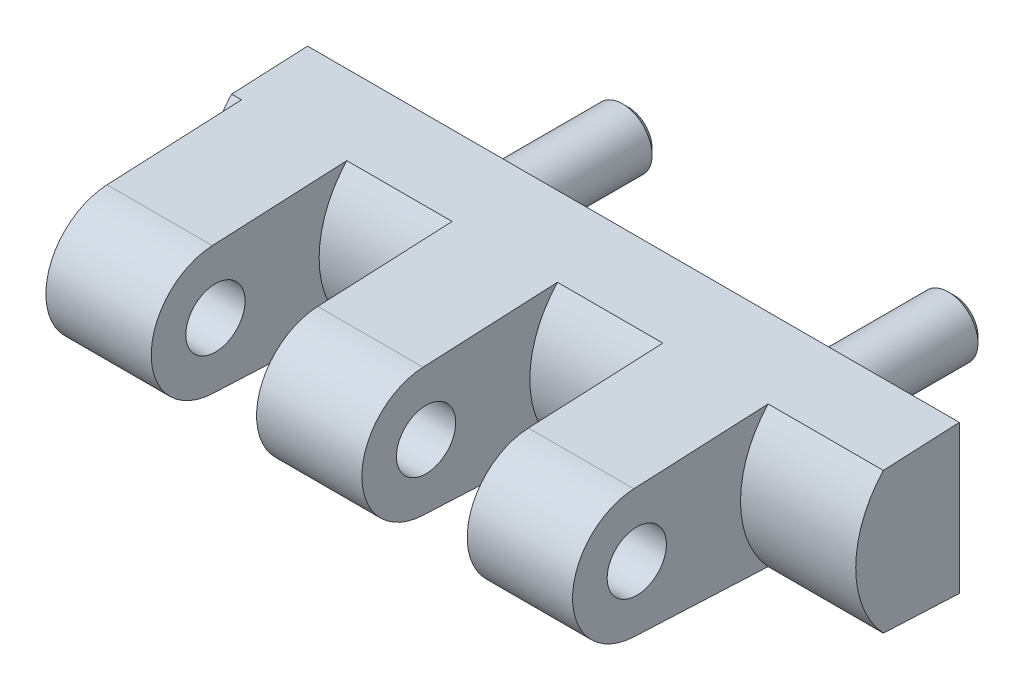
ISO-10303-21;
HEADER;
FILE_DESCRIPTION(('STEP AP214'),'2;1');
FILE_NAME('part.step','',(''),(''),'','','');
FILE_SCHEMA(('AUTOMOTIVE_DESIGN { 1 0 10303 214 1 1 1 1 }'));
ENDSEC;
DATA;
#1=APPLICATION_CONTEXT('core data for automotive mechanical design processes');
#2=APPLICATION_PROTOCOL_DEFINITION('international standard','automotive_design',2000,#1);
#3=PRODUCT_CONTEXT('',#1,'mechanical');
#4=PRODUCT('Part','Part','',(#3));
#5=PRODUCT_RELATED_PRODUCT_CATEGORY('part','',(#4));
#6=PRODUCT_DEFINITION_FORMATION('','',#4);
#7=PRODUCT_DEFINITION_CONTEXT('part definition',#1,'design');
#8=PRODUCT_DEFINITION('design','',#6,#7);
#9=PRODUCT_DEFINITION_SHAPE('','',#8);
#10=(LENGTH_UNIT() NAMED_UNIT(*) SI_UNIT(.MILLI.,.METRE.));
#11=(NAMED_UNIT(*) PLANE_ANGLE_UNIT() SI_UNIT($,.RADIAN.));
#12=(NAMED_UNIT(*) SI_UNIT($,.STERADIAN.) SOLID_ANGLE_UNIT());
#13=UNCERTAINTY_MEASURE_WITH_UNIT(LENGTH_MEASURE(1.E-05),#10,'distance_accuracy_value','');
#14=(GEOMETRIC_REPRESENTATION_CONTEXT(3) GLOBAL_UNCERTAINTY_ASSIGNED_CONTEXT((#13)) GLOBAL_UNIT_ASSIGNED_CONTEXT((#10,
#11,#12)) REPRESENTATION_CONTEXT('',''));
#15=CARTESIAN_POINT('',(0.,0.,0.));
#16=DIRECTION('',(0.,0.,1.));
#17=DIRECTION('',(1.,0.,0.));
#18=AXIS2_PLACEMENT_3D('',#15,#16,#17);
#19=CARTESIAN_POINT('',(37.833333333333,-10.496183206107,0.));
#20=DIRECTION('',(1.,0.,0.));
#21=DIRECTION('',(0.,-1.,0.));
#22=AXIS2_PLACEMENT_3D('',#19,#20,#21);
#23=PLANE('',#22);
#24=CARTESIAN_POINT('',(37.833333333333,0.,21.));
#25=DIRECTION('',(-1.,0.,0.));
#26=DIRECTION('',(0.,-1.,0.));
#27=AXIS2_PLACEMENT_3D('',#24,#25,#26);
#28=CIRCLE('',#27,6.5);
#29=CARTESIAN_POINT('',(37.833333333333,6.4927491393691,21.306934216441));
#30=VERTEX_POINT('',#29);
#31=CARTESIAN_POINT('',(37.833333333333,-6.4927491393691,21.306934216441));
#32=VERTEX_POINT('',#31);
#33=EDGE_CURVE('E247',#30,#32,#28,.F.);
#34=ORIENTED_EDGE('',*,*,#33,.T.);
#35=DIRECTION('',(0.,-0.0472206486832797,-0.998884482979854));
#36=VECTOR('',#35,1.);
#37=CARTESIAN_POINT('',(37.833333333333,-7.5,0.));
#38=LINE('',#37,#36);
#39=CARTESIAN_POINT('',(37.833333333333,-7.13613161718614,7.69710903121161));
#40=VERTEX_POINT('',#39);
#41=EDGE_CURVE('E202',#32,#40,#38,.T.);
#42=ORIENTED_EDGE('',*,*,#41,.T.);
#43=CARTESIAN_POINT('',(37.833333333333,0.,0.));
#44=DIRECTION('',(-1.,0.,0.));
#45=DIRECTION('',(0.,-1.,0.));
#46=AXIS2_PLACEMENT_3D('',#43,#44,#45);
#47=CIRCLE('',#46,10.496183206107);
#48=CARTESIAN_POINT('',(37.833333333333,7.13613161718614,7.69710903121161));
#49=VERTEX_POINT('',#48);
#50=EDGE_CURVE('E181',#40,#49,#47,.T.);
#51=ORIENTED_EDGE('',*,*,#50,.T.);
#52=DIRECTION('',(0.,0.0472206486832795,-0.998884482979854));
#53=VECTOR('',#52,1.);
#54=CARTESIAN_POINT('',(37.833333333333,6.4927491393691,21.306934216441));
#55=LINE('',#54,#53);
#56=EDGE_CURVE('E172',#30,#49,#55,.T.);
#57=ORIENTED_EDGE('',*,*,#56,.F.);
#58=EDGE_LOOP('',(#34,#42,#51,#57));
#59=FACE_BOUND('',#58,.T.);
#60=CARTESIAN_POINT('',(37.833333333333,0.,21.));
#61=DIRECTION('',(-1.,0.,0.));
#62=DIRECTION('',(0.,-1.,0.));
#63=AXIS2_PLACEMENT_3D('',#60,#61,#62);
#64=CIRCLE('',#63,3.);
#65=CARTESIAN_POINT('',(37.833333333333,-3.,21.));
#66=VERTEX_POINT('',#65);
#67=EDGE_CURVE('E360',#66,#66,#64,.F.);
#68=ORIENTED_EDGE('',*,*,#67,.F.);
#69=EDGE_LOOP('',(#68));
#70=FACE_BOUND('',#69,.T.);
#71=ADVANCED_FACE('F14',(#59,#70),#23,.T.);
#72=CARTESIAN_POINT('',(27.166666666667,-33.,0.));
#73=DIRECTION('',(-1.,0.,0.));
#74=DIRECTION('',(0.,1.,0.));
#75=AXIS2_PLACEMENT_3D('',#72,#73,#74);
#76=PLANE('',#75);
#77=CARTESIAN_POINT('',(27.166666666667,0.,0.));
#78=DIRECTION('',(-1.,0.,0.));
#79=DIRECTION('',(0.,-1.,0.));
#80=AXIS2_PLACEMENT_3D('',#77,#78,#79);
#81=CIRCLE('',#80,10.496183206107);
#82=CARTESIAN_POINT('',(27.166666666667,-7.13613161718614,7.69710903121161));
#83=VERTEX_POINT('',#82);
#84=CARTESIAN_POINT('',(27.166666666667,7.13613161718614,7.69710903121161));
#85=VERTEX_POINT('',#84);
#86=EDGE_CURVE('E138',#83,#85,#81,.T.);
#87=ORIENTED_EDGE('',*,*,#86,.F.);
#88=DIRECTION('',(0.,0.0472206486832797,0.998884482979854));
#89=VECTOR('',#88,1.);
#90=CARTESIAN_POINT('',(27.166666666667,-7.5,0.));
#91=LINE('',#90,#89);
#92=CARTESIAN_POINT('',(27.166666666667,-6.4927491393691,21.306934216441));
#93=VERTEX_POINT('',#92);
#94=EDGE_CURVE('E199',#83,#93,#91,.T.);
#95=ORIENTED_EDGE('',*,*,#94,.T.);
#96=CARTESIAN_POINT('',(27.166666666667,0.,21.));
#97=DIRECTION('',(1.,0.,0.));
#98=DIRECTION('',(0.,1.,0.));
#99=AXIS2_PLACEMENT_3D('',#96,#97,#98);
#100=CIRCLE('',#99,6.5);
#101=CARTESIAN_POINT('',(27.166666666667,6.4927491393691,21.306934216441));
#102=VERTEX_POINT('',#101);
#103=EDGE_CURVE('E244',#93,#102,#100,.F.);
#104=ORIENTED_EDGE('',*,*,#103,.T.);
#105=DIRECTION('',(0.,-0.0472206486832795,0.998884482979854));
#106=VECTOR('',#105,1.);
#107=CARTESIAN_POINT('',(27.166666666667,6.4927491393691,21.306934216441));
#108=LINE('',#107,#106);
#109=EDGE_CURVE('E152',#85,#102,#108,.T.);
#110=ORIENTED_EDGE('',*,*,#109,.F.);
#111=EDGE_LOOP('',(#87,#95,#104,#110));
#112=FACE_BOUND('',#111,.T.);
#113=CARTESIAN_POINT('',(27.166666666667,0.,21.));
#114=DIRECTION('',(1.,0.,0.));
#115=DIRECTION('',(0.,1.,0.));
#116=AXIS2_PLACEMENT_3D('',#113,#114,#115);
#117=CIRCLE('',#116,3.);
#118=CARTESIAN_POINT('',(27.166666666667,3.,21.));
#119=VERTEX_POINT('',#118);
#120=EDGE_CURVE('E357',#119,#119,#117,.F.);
#121=ORIENTED_EDGE('',*,*,#120,.F.);
#122=EDGE_LOOP('',(#121));
#123=FACE_BOUND('',#122,.T.);
#124=ADVANCED_FACE('F280',(#112,#123),#76,.T.);
#125=CARTESIAN_POINT('',(-16.5,0.,21.));
#126=DIRECTION('',(1.,0.,0.));
#127=DIRECTION('',(0.,-1.,0.));
#128=AXIS2_PLACEMENT_3D('',#125,#126,#127);
#129=CYLINDRICAL_SURFACE('',#128,6.5);
#130=DIRECTION('',(1.,0.,0.));
#131=VECTOR('',#130,1.);
#132=CARTESIAN_POINT('',(-16.5,6.4927491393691,21.306934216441));
#133=LINE('',#132,#131);
#134=EDGE_CURVE('E216',#102,#30,#133,.T.);
#135=ORIENTED_EDGE('',*,*,#134,.F.);
#136=ORIENTED_EDGE('',*,*,#103,.F.);
#137=DIRECTION('',(1.,0.,0.));
#138=VECTOR('',#137,1.);
#139=CARTESIAN_POINT('',(-16.5,-6.4927491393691,21.306934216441));
#140=LINE('',#139,#138);
#141=EDGE_CURVE('E220',#93,#32,#140,.T.);
#142=ORIENTED_EDGE('',*,*,#141,.T.);
#143=ORIENTED_EDGE('',*,*,#33,.F.);
#144=EDGE_LOOP('',(#135,#136,#142,#143));
#145=FACE_BOUND('',#144,.T.);
#146=ADVANCED_FACE('F287',(#145),#129,.T.);
#147=CARTESIAN_POINT('',(5.833333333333,6.4927491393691,21.306934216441));
#148=VERTEX_POINT('',#147);
#149=CARTESIAN_POINT('',(16.5,6.4927491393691,21.306934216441));
#150=VERTEX_POINT('',#149);
#151=EDGE_CURVE('E151',#148,#150,#133,.T.);
#152=ORIENTED_EDGE('',*,*,#151,.F.);
#153=CARTESIAN_POINT('',(5.833333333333,0.,21.));
#154=DIRECTION('',(1.,0.,0.));
#155=DIRECTION('',(0.,1.,0.));
#156=AXIS2_PLACEMENT_3D('',#153,#154,#155);
#157=CIRCLE('',#156,6.5);
#158=CARTESIAN_POINT('',(5.833333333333,-6.4927491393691,21.306934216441));
#159=VERTEX_POINT('',#158);
#160=EDGE_CURVE('E239',#159,#148,#157,.F.);
#161=ORIENTED_EDGE('',*,*,#160,.F.);
#162=CARTESIAN_POINT('',(16.5,-6.4927491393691,21.306934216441));
#163=VERTEX_POINT('',#162);
#164=EDGE_CURVE('E222',#159,#163,#140,.T.);
#165=ORIENTED_EDGE('',*,*,#164,.T.);
#166=CARTESIAN_POINT('',(16.5,0.,21.));
#167=DIRECTION('',(-1.,0.,0.));
#168=DIRECTION('',(0.,-1.,0.));
#169=AXIS2_PLACEMENT_3D('',#166,#167,#168);
#170=CIRCLE('',#169,6.5);
#171=EDGE_CURVE('E242',#150,#163,#170,.F.);
#172=ORIENTED_EDGE('',*,*,#171,.F.);
#173=EDGE_LOOP('',(#152,#161,#165,#172));
#174=FACE_BOUND('',#173,.T.);
#175=ADVANCED_FACE('F310',(#174),#129,.T.);
#176=CARTESIAN_POINT('',(-16.5,-7.5,0.));
#177=DIRECTION('',(0.,-0.998884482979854,0.0472206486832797));
#178=DIRECTION('',(0.,0.0472206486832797,0.998884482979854));
#179=AXIS2_PLACEMENT_3D('',#176,#177,#178);
#180=PLANE('',#179);
#181=ORIENTED_EDGE('',*,*,#41,.F.);
#182=ORIENTED_EDGE('',*,*,#141,.F.);
#183=ORIENTED_EDGE('',*,*,#94,.F.);
#184=DIRECTION('',(1.,0.,0.));
#185=VECTOR('',#184,1.);
#186=CARTESIAN_POINT('',(-33.5,-7.13613161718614,7.69710903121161));
#187=LINE('',#186,#185);
#188=CARTESIAN_POINT('',(16.5,-7.13613161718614,7.69710903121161));
#189=VERTEX_POINT('',#188);
#190=EDGE_CURVE('E253',#189,#83,#187,.T.);
#191=ORIENTED_EDGE('',*,*,#190,.F.);
#192=DIRECTION('',(0.,-0.0472206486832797,-0.998884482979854));
#193=VECTOR('',#192,1.);
#194=CARTESIAN_POINT('',(16.5,-7.5,0.));
#195=LINE('',#194,#193);
#196=EDGE_CURVE('E135',#163,#189,#195,.T.);
#197=ORIENTED_EDGE('',*,*,#196,.F.);
#198=ORIENTED_EDGE('',*,*,#164,.F.);
#199=DIRECTION('',(0.,0.0472206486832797,0.998884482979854));
#200=VECTOR('',#199,1.);
#201=CARTESIAN_POINT('',(5.833333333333,-7.5,0.));
#202=LINE('',#201,#200);
#203=CARTESIAN_POINT('',(5.833333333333,-7.13613161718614,7.69710903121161));
#204=VERTEX_POINT('',#203);
#205=EDGE_CURVE('E196',#204,#159,#202,.T.);
#206=ORIENTED_EDGE('',*,*,#205,.F.);
#207=DIRECTION('',(1.,0.,0.));
#208=VECTOR('',#207,1.);
#209=CARTESIAN_POINT('',(-33.5,-7.13613161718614,7.69710903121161));
#210=LINE('',#209,#208);
#211=CARTESIAN_POINT('',(-4.833333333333,-7.13613161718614,7.69710903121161));
#212=VERTEX_POINT('',#211);
#213=EDGE_CURVE('E250',#212,#204,#210,.T.);
#214=ORIENTED_EDGE('',*,*,#213,.F.);
#215=DIRECTION('',(0.,-0.0472206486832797,-0.998884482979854));
#216=VECTOR('',#215,1.);
#217=CARTESIAN_POINT('',(-4.833333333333,-7.5,0.));
#218=LINE('',#217,#216);
#219=CARTESIAN_POINT('',(-4.833333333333,-6.4927491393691,21.306934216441));
#220=VERTEX_POINT('',#219);
#221=EDGE_CURVE('E193',#220,#212,#218,.T.);
#222=ORIENTED_EDGE('',*,*,#221,.F.);
#223=CARTESIAN_POINT('',(-15.5,-6.4927491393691,21.306934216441));
#224=VERTEX_POINT('',#223);
#225=EDGE_CURVE('E223',#224,#220,#140,.T.);
#226=ORIENTED_EDGE('',*,*,#225,.F.);
#227=DIRECTION('',(0.,0.0472206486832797,0.998884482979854));
#228=VECTOR('',#227,1.);
#229=CARTESIAN_POINT('',(-15.5,-7.5,0.));
#230=LINE('',#229,#228);
#231=CARTESIAN_POINT('',(-15.5,-7.13613161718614,7.69710903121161));
#232=VERTEX_POINT('',#231);
#233=EDGE_CURVE('E190',#232,#224,#230,.T.);
#234=ORIENTED_EDGE('',*,*,#233,.F.);
#235=DIRECTION('',(1.,0.,0.));
#236=VECTOR('',#235,1.);
#237=CARTESIAN_POINT('',(-33.5,-7.13613161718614,7.69710903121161));
#238=LINE('',#237,#236);
#239=CARTESIAN_POINT('',(-16.5,-7.13613161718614,7.69710903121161));
#240=VERTEX_POINT('',#239);
#241=EDGE_CURVE('E187',#240,#232,#238,.T.);
#242=ORIENTED_EDGE('',*,*,#241,.F.);
#243=DIRECTION('',(0.,0.0472206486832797,0.998884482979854));
#244=VECTOR('',#243,1.);
#245=CARTESIAN_POINT('',(-16.5,-7.5,0.));
#246=LINE('',#245,#244);
#247=CARTESIAN_POINT('',(-16.5,-7.5,0.));
#248=VERTEX_POINT('',#247);
#249=EDGE_CURVE('E214',#248,#240,#246,.T.);
#250=ORIENTED_EDGE('',*,*,#249,.F.);
#251=DIRECTION('',(1.,0.,0.));
#252=VECTOR('',#251,1.);
#253=CARTESIAN_POINT('',(-16.5,-7.5,0.));
#254=LINE('',#253,#252);
#255=CARTESIAN_POINT('',(49.5,-7.5,0.));
#256=VERTEX_POINT('',#255);
#257=EDGE_CURVE('E224',#248,#256,#254,.T.);
#258=ORIENTED_EDGE('',*,*,#257,.T.);
#259=DIRECTION('',(0.,0.0472206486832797,0.998884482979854));
#260=VECTOR('',#259,1.);
#261=CARTESIAN_POINT('',(49.5,-7.5,0.));
#262=LINE('',#261,#260);
#263=CARTESIAN_POINT('',(49.5,-7.13613161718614,7.69710903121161));
#264=VERTEX_POINT('',#263);
#265=EDGE_CURVE('E208',#256,#264,#262,.T.);
#266=ORIENTED_EDGE('',*,*,#265,.T.);
#267=DIRECTION('',(1.,0.,0.));
#268=VECTOR('',#267,1.);
#269=CARTESIAN_POINT('',(-33.5,-7.13613161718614,7.69710903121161));
#270=LINE('',#269,#268);
#271=EDGE_CURVE('E184',#40,#264,#270,.T.);
#272=ORIENTED_EDGE('',*,*,#271,.F.);
#273=EDGE_LOOP('',(#181,#182,#183,#191,#197,#198,#206,#214,#222,#226,#234,#242,#250,#258,#266,#272));
#274=FACE_BOUND('',#273,.T.);
#275=ADVANCED_FACE('F308',(#274),#180,.T.);
#276=CARTESIAN_POINT('',(-15.5,6.4927491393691,21.306934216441));
#277=VERTEX_POINT('',#276);
#278=CARTESIAN_POINT('',(-4.833333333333,6.4927491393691,21.306934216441));
#279=VERTEX_POINT('',#278);
#280=EDGE_CURVE('E219',#277,#279,#133,.T.);
#281=ORIENTED_EDGE('',*,*,#280,.F.);
#282=CARTESIAN_POINT('',(-15.5,0.,21.));
#283=DIRECTION('',(1.,0.,0.));
#284=DIRECTION('',(0.,1.,0.));
#285=AXIS2_PLACEMENT_3D('',#282,#283,#284);
#286=CIRCLE('',#285,6.5);
#287=EDGE_CURVE('E234',#224,#277,#286,.F.);
#288=ORIENTED_EDGE('',*,*,#287,.F.);
#289=ORIENTED_EDGE('',*,*,#225,.T.);
#290=CARTESIAN_POINT('',(-4.833333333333,0.,21.));
#291=DIRECTION('',(-1.,0.,0.));
#292=DIRECTION('',(0.,-1.,0.));
#293=AXIS2_PLACEMENT_3D('',#290,#291,#292);
#294=CIRCLE('',#293,6.5);
#295=EDGE_CURVE('E237',#279,#220,#294,.F.);
#296=ORIENTED_EDGE('',*,*,#295,.F.);
#297=EDGE_LOOP('',(#281,#288,#289,#296));
#298=FACE_BOUND('',#297,.T.);
#299=ADVANCED_FACE('F305',(#298),#129,.T.);
#300=CARTESIAN_POINT('',(-16.5,0.,21.));
#301=DIRECTION('',(1.,0.,0.));
#302=DIRECTION('',(0.,-1.,0.));
#303=AXIS2_PLACEMENT_3D('',#300,#301,#302);
#304=PLANE('',#303);
#305=DIRECTION('',(0.,0.0472206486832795,-0.998884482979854));
#306=VECTOR('',#305,1.);
#307=CARTESIAN_POINT('',(-16.5,6.4927491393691,21.306934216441));
#308=LINE('',#307,#306);
#309=CARTESIAN_POINT('',(-16.5,7.13613161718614,7.69710903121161));
#310=VERTEX_POINT('',#309);
#311=CARTESIAN_POINT('',(-16.5,7.5,0.));
#312=VERTEX_POINT('',#311);
#313=EDGE_CURVE('E211',#310,#312,#308,.T.);
#314=ORIENTED_EDGE('',*,*,#313,.T.);
#315=DIRECTION('',(0.,-1.,0.));
#316=VECTOR('',#315,1.);
#317=CARTESIAN_POINT('',(-16.5,7.5,0.));
#318=LINE('',#317,#316);
#319=EDGE_CURVE('E29',#312,#248,#318,.T.);
#320=ORIENTED_EDGE('',*,*,#319,.T.);
#321=ORIENTED_EDGE('',*,*,#249,.T.);
#322=CARTESIAN_POINT('',(-16.5,0.,0.));
#323=DIRECTION('',(-1.,0.,0.));
#324=DIRECTION('',(0.,-1.,0.));
#325=AXIS2_PLACEMENT_3D('',#322,#323,#324);
#326=CIRCLE('',#325,10.496183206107);
#327=EDGE_CURVE('E231',#240,#310,#326,.T.);
#328=ORIENTED_EDGE('',*,*,#327,.T.);
#329=EDGE_LOOP('',(#314,#320,#321,#328));
#330=FACE_BOUND('',#329,.T.);
#331=ADVANCED_FACE('F301',(#330),#304,.F.);
#332=CARTESIAN_POINT('',(49.5,0.,21.));
#333=DIRECTION('',(1.,0.,0.));
#334=DIRECTION('',(0.,-1.,0.));
#335=AXIS2_PLACEMENT_3D('',#332,#333,#334);
#336=PLANE('',#335);
#337=CARTESIAN_POINT('',(49.5,0.,0.));
#338=DIRECTION('',(-1.,0.,0.));
#339=DIRECTION('',(0.,-1.,0.));
#340=AXIS2_PLACEMENT_3D('',#337,#338,#339);
#341=CIRCLE('',#340,10.496183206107);
#342=CARTESIAN_POINT('',(49.5,7.13613161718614,7.69710903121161));
#343=VERTEX_POINT('',#342);
#344=EDGE_CURVE('E228',#264,#343,#341,.T.);
#345=ORIENTED_EDGE('',*,*,#344,.F.);
#346=ORIENTED_EDGE('',*,*,#265,.F.);
#347=DIRECTION('',(0.,-1.,0.));
#348=VECTOR('',#347,1.);
#349=CARTESIAN_POINT('',(49.5,7.5,0.));
#350=LINE('',#349,#348);
#351=CARTESIAN_POINT('',(49.5,7.5,0.));
#352=VERTEX_POINT('',#351);
#353=EDGE_CURVE('E206',#352,#256,#350,.T.);
#354=ORIENTED_EDGE('',*,*,#353,.F.);
#355=DIRECTION('',(0.,0.0472206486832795,-0.998884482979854));
#356=VECTOR('',#355,1.);
#357=CARTESIAN_POINT('',(49.5,6.4927491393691,21.306934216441));
#358=LINE('',#357,#356);
#359=EDGE_CURVE('E205',#343,#352,#358,.T.);
#360=ORIENTED_EDGE('',*,*,#359,.F.);
#361=EDGE_LOOP('',(#345,#346,#354,#360));
#362=FACE_BOUND('',#361,.T.);
#363=ADVANCED_FACE('F298',(#362),#336,.T.);
#364=CARTESIAN_POINT('',(-16.5,6.4927491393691,21.306934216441));
#365=DIRECTION('',(0.,0.998884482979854,0.0472206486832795));
#366=DIRECTION('',(0.,0.0472206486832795,-0.998884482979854));
#367=AXIS2_PLACEMENT_3D('',#364,#365,#366);
#368=PLANE('',#367);
#369=DIRECTION('',(-1.,0.,0.));
#370=VECTOR('',#369,1.);
#371=CARTESIAN_POINT('',(-33.5,7.13613161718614,7.69710903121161));
#372=LINE('',#371,#370);
#373=EDGE_CURVE('E170',#49,#343,#372,.F.);
#374=ORIENTED_EDGE('',*,*,#373,.T.);
#375=ORIENTED_EDGE('',*,*,#359,.T.);
#376=DIRECTION('',(1.,0.,0.));
#377=VECTOR('',#376,1.);
#378=CARTESIAN_POINT('',(-16.5,7.5,0.));
#379=LINE('',#378,#377);
#380=EDGE_CURVE('E37',#312,#352,#379,.T.);
#381=ORIENTED_EDGE('',*,*,#380,.F.);
#382=ORIENTED_EDGE('',*,*,#313,.F.);
#383=DIRECTION('',(-1.,0.,0.));
#384=VECTOR('',#383,1.);
#385=CARTESIAN_POINT('',(-33.5,7.13613161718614,7.69710903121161));
#386=LINE('',#385,#384);
#387=CARTESIAN_POINT('',(-15.5,7.13613161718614,7.69710903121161));
#388=VERTEX_POINT('',#387);
#389=EDGE_CURVE('E165',#310,#388,#386,.F.);
#390=ORIENTED_EDGE('',*,*,#389,.T.);
#391=DIRECTION('',(0.,-0.0472206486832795,0.998884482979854));
#392=VECTOR('',#391,1.);
#393=CARTESIAN_POINT('',(-15.5,6.4927491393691,21.306934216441));
#394=LINE('',#393,#392);
#395=EDGE_CURVE('E168',#388,#277,#394,.T.);
#396=ORIENTED_EDGE('',*,*,#395,.T.);
#397=ORIENTED_EDGE('',*,*,#280,.T.);
#398=DIRECTION('',(0.,0.0472206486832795,-0.998884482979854));
#399=VECTOR('',#398,1.);
#400=CARTESIAN_POINT('',(-4.833333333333,6.4927491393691,21.306934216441));
#401=LINE('',#400,#399);
#402=CARTESIAN_POINT('',(-4.833333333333,7.13613161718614,7.69710903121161));
#403=VERTEX_POINT('',#402);
#404=EDGE_CURVE('E154',#279,#403,#401,.T.);
#405=ORIENTED_EDGE('',*,*,#404,.T.);
#406=DIRECTION('',(-1.,0.,0.));
#407=VECTOR('',#406,1.);
#408=CARTESIAN_POINT('',(-33.5,7.13613161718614,7.69710903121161));
#409=LINE('',#408,#407);
#410=CARTESIAN_POINT('',(5.833333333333,7.13613161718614,7.69710903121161));
#411=VERTEX_POINT('',#410);
#412=EDGE_CURVE('E162',#403,#411,#409,.F.);
#413=ORIENTED_EDGE('',*,*,#412,.T.);
#414=DIRECTION('',(0.,-0.0472206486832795,0.998884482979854));
#415=VECTOR('',#414,1.);
#416=CARTESIAN_POINT('',(5.833333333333,6.4927491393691,21.306934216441));
#417=LINE('',#416,#415);
#418=EDGE_CURVE('E160',#411,#148,#417,.T.);
#419=ORIENTED_EDGE('',*,*,#418,.T.);
#420=ORIENTED_EDGE('',*,*,#151,.T.);
#421=DIRECTION('',(0.,0.0472206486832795,-0.998884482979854));
#422=VECTOR('',#421,1.);
#423=CARTESIAN_POINT('',(16.5,6.4927491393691,21.306934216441));
#424=LINE('',#423,#422);
#425=CARTESIAN_POINT('',(16.5,7.13613161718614,7.69710903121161));
#426=VERTEX_POINT('',#425);
#427=EDGE_CURVE('E133',#150,#426,#424,.T.);
#428=ORIENTED_EDGE('',*,*,#427,.T.);
#429=DIRECTION('',(-1.,0.,0.));
#430=VECTOR('',#429,1.);
#431=CARTESIAN_POINT('',(-33.5,7.13613161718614,7.69710903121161));
#432=LINE('',#431,#430);
#433=EDGE_CURVE('E142',#426,#85,#432,.F.);
#434=ORIENTED_EDGE('',*,*,#433,.T.);
#435=ORIENTED_EDGE('',*,*,#109,.T.);
#436=ORIENTED_EDGE('',*,*,#134,.T.);
#437=ORIENTED_EDGE('',*,*,#56,.T.);
#438=EDGE_LOOP('',(#374,#375,#381,#382,#390,#396,#397,#405,#413,#419,#420,#428,#434,#435,#436,#437));
#439=FACE_BOUND('',#438,.T.);
#440=ADVANCED_FACE('F16',(#439),#368,.T.);
#441=CARTESIAN_POINT('',(-16.5,7.5,0.));
#442=DIRECTION('',(0.,0.,-1.));
#443=DIRECTION('',(-1.,0.,0.));
#444=AXIS2_PLACEMENT_3D('',#441,#442,#443);
#445=PLANE('',#444);
#446=CARTESIAN_POINT('',(0.,0.,0.));
#447=DIRECTION('',(0.,0.,1.));
#448=DIRECTION('',(-1.,0.,0.));
#449=AXIS2_PLACEMENT_3D('',#446,#447,#448);
#450=CIRCLE('',#449,3.);
#451=CARTESIAN_POINT('',(-3.,0.,0.));
#452=VERTEX_POINT('',#451);
#453=EDGE_CURVE('E9',#452,#452,#450,.T.);
#454=ORIENTED_EDGE('',*,*,#453,.T.);
#455=EDGE_LOOP('',(#454));
#456=FACE_BOUND('',#455,.T.);
#457=CARTESIAN_POINT('',(33.,0.,0.));
#458=DIRECTION('',(0.,0.,1.));
#459=DIRECTION('',(-1.,0.,0.));
#460=AXIS2_PLACEMENT_3D('',#457,#458,#459);
#461=CIRCLE('',#460,3.);
#462=CARTESIAN_POINT('',(30.,0.,0.));
#463=VERTEX_POINT('',#462);
#464=EDGE_CURVE('E22',#463,#463,#461,.T.);
#465=ORIENTED_EDGE('',*,*,#464,.T.);
#466=EDGE_LOOP('',(#465));
#467=FACE_BOUND('',#466,.T.);
#468=ORIENTED_EDGE('',*,*,#257,.F.);
#469=ORIENTED_EDGE('',*,*,#319,.F.);
#470=ORIENTED_EDGE('',*,*,#380,.T.);
#471=ORIENTED_EDGE('',*,*,#353,.T.);
#472=EDGE_LOOP('',(#468,#469,#470,#471));
#473=FACE_BOUND('',#472,.T.);
#474=ADVANCED_FACE('F257',(#456,#467,#473),#445,.T.);
#475=CARTESIAN_POINT('',(-33.5,0.,0.));
#476=DIRECTION('',(1.,0.,0.));
#477=DIRECTION('',(0.,-1.,0.));
#478=AXIS2_PLACEMENT_3D('',#475,#476,#477);
#479=CYLINDRICAL_SURFACE('',#478,10.496183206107);
#480=ORIENTED_EDGE('',*,*,#50,.F.);
#481=ORIENTED_EDGE('',*,*,#271,.T.);
#482=ORIENTED_EDGE('',*,*,#344,.T.);
#483=ORIENTED_EDGE('',*,*,#373,.F.);
#484=EDGE_LOOP('',(#480,#481,#482,#483));
#485=FACE_BOUND('',#484,.T.);
#486=ADVANCED_FACE('F293',(#485),#479,.T.);
#487=CARTESIAN_POINT('',(-33.5,0.,0.));
#488=DIRECTION('',(1.,0.,0.));
#489=DIRECTION('',(0.,-1.,0.));
#490=AXIS2_PLACEMENT_3D('',#487,#488,#489);
#491=CYLINDRICAL_SURFACE('',#490,10.496183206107);
#492=ORIENTED_EDGE('',*,*,#327,.F.);
#493=ORIENTED_EDGE('',*,*,#241,.T.);
#494=CARTESIAN_POINT('',(-15.5,0.,0.));
#495=DIRECTION('',(-1.,0.,0.));
#496=DIRECTION('',(0.,-1.,0.));
#497=AXIS2_PLACEMENT_3D('',#494,#495,#496);
#498=CIRCLE('',#497,10.496183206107);
#499=EDGE_CURVE('E175',#232,#388,#498,.T.);
#500=ORIENTED_EDGE('',*,*,#499,.T.);
#501=ORIENTED_EDGE('',*,*,#389,.F.);
#502=EDGE_LOOP('',(#492,#493,#500,#501));
#503=FACE_BOUND('',#502,.T.);
#504=ADVANCED_FACE('F296',(#503),#491,.T.);
#505=CARTESIAN_POINT('',(-15.5,-33.,0.));
#506=DIRECTION('',(-1.,0.,0.));
#507=DIRECTION('',(0.,1.,0.));
#508=AXIS2_PLACEMENT_3D('',#505,#506,#507);
#509=PLANE('',#508);
#510=CARTESIAN_POINT('',(-15.5,0.,21.));
#511=DIRECTION('',(1.,0.,0.));
#512=DIRECTION('',(0.,1.,0.));
#513=AXIS2_PLACEMENT_3D('',#510,#511,#512);
#514=CIRCLE('',#513,3.);
#515=CARTESIAN_POINT('',(-15.5,3.,21.));
#516=VERTEX_POINT('',#515);
#517=EDGE_CURVE('E147',#516,#516,#514,.T.);
#518=ORIENTED_EDGE('',*,*,#517,.T.);
#519=EDGE_LOOP('',(#518));
#520=FACE_BOUND('',#519,.T.);
#521=ORIENTED_EDGE('',*,*,#499,.F.);
#522=ORIENTED_EDGE('',*,*,#233,.T.);
#523=ORIENTED_EDGE('',*,*,#287,.T.);
#524=ORIENTED_EDGE('',*,*,#395,.F.);
#525=EDGE_LOOP('',(#521,#522,#523,#524));
#526=FACE_BOUND('',#525,.T.);
#527=ADVANCED_FACE('F375',(#520,#526),#509,.T.);
#528=CARTESIAN_POINT('',(-4.833333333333,-10.496183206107,0.));
#529=DIRECTION('',(1.,0.,0.));
#530=DIRECTION('',(0.,-1.,0.));
#531=AXIS2_PLACEMENT_3D('',#528,#529,#530);
#532=PLANE('',#531);
#533=CARTESIAN_POINT('',(-4.833333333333,0.,21.));
#534=DIRECTION('',(-1.,0.,0.));
#535=DIRECTION('',(0.,-1.,0.));
#536=AXIS2_PLACEMENT_3D('',#533,#534,#535);
#537=CIRCLE('',#536,3.);
#538=CARTESIAN_POINT('',(-4.833333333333,-3.,21.));
#539=VERTEX_POINT('',#538);
#540=EDGE_CURVE('E370',#539,#539,#537,.T.);
#541=ORIENTED_EDGE('',*,*,#540,.T.);
#542=EDGE_LOOP('',(#541));
#543=FACE_BOUND('',#542,.T.);
#544=ORIENTED_EDGE('',*,*,#295,.T.);
#545=ORIENTED_EDGE('',*,*,#221,.T.);
#546=CARTESIAN_POINT('',(-4.833333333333,0.,0.));
#547=DIRECTION('',(-1.,0.,0.));
#548=DIRECTION('',(0.,-1.,0.));
#549=AXIS2_PLACEMENT_3D('',#546,#547,#548);
#550=CIRCLE('',#549,10.496183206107);
#551=EDGE_CURVE('E177',#212,#403,#550,.T.);
#552=ORIENTED_EDGE('',*,*,#551,.T.);
#553=ORIENTED_EDGE('',*,*,#404,.F.);
#554=EDGE_LOOP('',(#544,#545,#552,#553));
#555=FACE_BOUND('',#554,.T.);
#556=ADVANCED_FACE('F384',(#543,#555),#532,.T.);
#557=CARTESIAN_POINT('',(5.833333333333,-33.,0.));
#558=DIRECTION('',(-1.,0.,0.));
#559=DIRECTION('',(0.,1.,0.));
#560=AXIS2_PLACEMENT_3D('',#557,#558,#559);
#561=PLANE('',#560);
#562=CARTESIAN_POINT('',(5.833333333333,0.,21.));
#563=DIRECTION('',(1.,0.,0.));
#564=DIRECTION('',(0.,1.,0.));
#565=AXIS2_PLACEMENT_3D('',#562,#563,#564);
#566=CIRCLE('',#565,3.);
#567=CARTESIAN_POINT('',(5.833333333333,3.,21.));
#568=VERTEX_POINT('',#567);
#569=EDGE_CURVE('E367',#568,#568,#566,.T.);
#570=ORIENTED_EDGE('',*,*,#569,.T.);
#571=EDGE_LOOP('',(#570));
#572=FACE_BOUND('',#571,.T.);
#573=CARTESIAN_POINT('',(5.833333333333,0.,0.));
#574=DIRECTION('',(-1.,0.,0.));
#575=DIRECTION('',(0.,-1.,0.));
#576=AXIS2_PLACEMENT_3D('',#573,#574,#575);
#577=CIRCLE('',#576,10.496183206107);
#578=EDGE_CURVE('E139',#204,#411,#577,.T.);
#579=ORIENTED_EDGE('',*,*,#578,.F.);
#580=ORIENTED_EDGE('',*,*,#205,.T.);
#581=ORIENTED_EDGE('',*,*,#160,.T.);
#582=ORIENTED_EDGE('',*,*,#418,.F.);
#583=EDGE_LOOP('',(#579,#580,#581,#582));
#584=FACE_BOUND('',#583,.T.);
#585=ADVANCED_FACE('F387',(#572,#584),#561,.T.);
#586=CARTESIAN_POINT('',(-33.5,0.,0.));
#587=DIRECTION('',(1.,0.,0.));
#588=DIRECTION('',(0.,-1.,0.));
#589=AXIS2_PLACEMENT_3D('',#586,#587,#588);
#590=CYLINDRICAL_SURFACE('',#589,10.496183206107);
#591=ORIENTED_EDGE('',*,*,#551,.F.);
#592=ORIENTED_EDGE('',*,*,#213,.T.);
#593=ORIENTED_EDGE('',*,*,#578,.T.);
#594=ORIENTED_EDGE('',*,*,#412,.F.);
#595=EDGE_LOOP('',(#591,#592,#593,#594));
#596=FACE_BOUND('',#595,.T.);
#597=ADVANCED_FACE('F401',(#596),#590,.T.);
#598=CARTESIAN_POINT('',(-33.5,0.,0.));
#599=DIRECTION('',(1.,0.,0.));
#600=DIRECTION('',(0.,-1.,0.));
#601=AXIS2_PLACEMENT_3D('',#598,#599,#600);
#602=CYLINDRICAL_SURFACE('',#601,10.496183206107);
#603=CARTESIAN_POINT('',(16.5,0.,0.));
#604=DIRECTION('',(-1.,0.,0.));
#605=DIRECTION('',(0.,-1.,0.));
#606=AXIS2_PLACEMENT_3D('',#603,#604,#605);
#607=CIRCLE('',#606,10.496183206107);
#608=EDGE_CURVE('E128',#189,#426,#607,.T.);
#609=ORIENTED_EDGE('',*,*,#608,.F.);
#610=ORIENTED_EDGE('',*,*,#190,.T.);
#611=ORIENTED_EDGE('',*,*,#86,.T.);
#612=ORIENTED_EDGE('',*,*,#433,.F.);
#613=EDGE_LOOP('',(#609,#610,#611,#612));
#614=FACE_BOUND('',#613,.T.);
#615=ADVANCED_FACE('F143',(#614),#602,.T.);
#616=CARTESIAN_POINT('',(16.5,-10.496183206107,0.));
#617=DIRECTION('',(1.,0.,0.));
#618=DIRECTION('',(0.,-1.,0.));
#619=AXIS2_PLACEMENT_3D('',#616,#617,#618);
#620=PLANE('',#619);
#621=CARTESIAN_POINT('',(16.5,0.,21.));
#622=DIRECTION('',(-1.,0.,0.));
#623=DIRECTION('',(0.,-1.,0.));
#624=AXIS2_PLACEMENT_3D('',#621,#622,#623);
#625=CIRCLE('',#624,3.);
#626=CARTESIAN_POINT('',(16.5,-3.,21.));
#627=VERTEX_POINT('',#626);
#628=EDGE_CURVE('E363',#627,#627,#625,.T.);
#629=ORIENTED_EDGE('',*,*,#628,.T.);
#630=EDGE_LOOP('',(#629));
#631=FACE_BOUND('',#630,.T.);
#632=ORIENTED_EDGE('',*,*,#171,.T.);
#633=ORIENTED_EDGE('',*,*,#196,.T.);
#634=ORIENTED_EDGE('',*,*,#608,.T.);
#635=ORIENTED_EDGE('',*,*,#427,.F.);
#636=EDGE_LOOP('',(#632,#633,#634,#635));
#637=FACE_BOUND('',#636,.T.);
#638=ADVANCED_FACE('F131',(#631,#637),#620,.T.);
#639=CARTESIAN_POINT('',(-16.5,0.,21.));
#640=DIRECTION('',(1.,0.,0.));
#641=DIRECTION('',(0.,-1.,0.));
#642=AXIS2_PLACEMENT_3D('',#639,#640,#641);
#643=CYLINDRICAL_SURFACE('',#642,3.);
#644=ORIENTED_EDGE('',*,*,#569,.F.);
#645=EDGE_LOOP('',(#644));
#646=FACE_BOUND('',#645,.T.);
#647=ORIENTED_EDGE('',*,*,#628,.F.);
#648=EDGE_LOOP('',(#647));
#649=FACE_BOUND('',#648,.T.);
#650=ADVANCED_FACE('F380',(#646,#649),#643,.F.);
#651=ORIENTED_EDGE('',*,*,#517,.F.);
#652=EDGE_LOOP('',(#651));
#653=FACE_BOUND('',#652,.T.);
#654=ORIENTED_EDGE('',*,*,#540,.F.);
#655=EDGE_LOOP('',(#654));
#656=FACE_BOUND('',#655,.T.);
#657=ADVANCED_FACE('F275',(#653,#656),#643,.F.);
#658=CARTESIAN_POINT('',(49.5,0.,21.));
#659=DIRECTION('',(-1.,0.,0.));
#660=DIRECTION('',(0.,1.,0.));
#661=AXIS2_PLACEMENT_3D('',#658,#659,#660);
#662=CYLINDRICAL_SURFACE('',#661,3.);
#663=ORIENTED_EDGE('',*,*,#67,.T.);
#664=EDGE_LOOP('',(#663));
#665=FACE_BOUND('',#664,.T.);
#666=ORIENTED_EDGE('',*,*,#120,.T.);
#667=EDGE_LOOP('',(#666));
#668=FACE_BOUND('',#667,.T.);
#669=ADVANCED_FACE('F263',(#665,#668),#662,.F.);
#670=CARTESIAN_POINT('',(33.,0.,-16.));
#671=DIRECTION('',(0.,0.,1.));
#672=DIRECTION('',(0.,1.,0.));
#673=AXIS2_PLACEMENT_3D('',#670,#671,#672);
#674=CYLINDRICAL_SURFACE('',#673,3.);
#675=CARTESIAN_POINT('',(33.,0.,-15.3865));
#676=DIRECTION('',(0.,0.,-1.));
#677=DIRECTION('',(0.,1.,0.));
#678=AXIS2_PLACEMENT_3D('',#675,#676,#677);
#679=CIRCLE('',#678,3.);
#680=CARTESIAN_POINT('',(33.,3.,-15.3865));
#681=VERTEX_POINT('',#680);
#682=EDGE_CURVE('E354',#681,#681,#679,.T.);
#683=ORIENTED_EDGE('',*,*,#682,.F.);
#684=EDGE_LOOP('',(#683));
#685=FACE_BOUND('',#684,.T.);
#686=ORIENTED_EDGE('',*,*,#464,.F.);
#687=EDGE_LOOP('',(#686));
#688=FACE_BOUND('',#687,.T.);
#689=ADVANCED_FACE('F260',(#685,#688),#674,.T.);
#690=CARTESIAN_POINT('',(33.,0.,-15.3865));
#691=DIRECTION('',(0.,0.,1.));
#692=DIRECTION('',(0.,1.,0.));
#693=AXIS2_PLACEMENT_3D('',#690,#691,#692);
#694=CONICAL_SURFACE('',#693,3.,0.78539816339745);
#695=CARTESIAN_POINT('',(33.,0.,-16.));
#696=DIRECTION('',(0.,0.,-1.));
#697=DIRECTION('',(0.,1.,0.));
#698=AXIS2_PLACEMENT_3D('',#695,#696,#697);
#699=CIRCLE('',#698,2.3865);
#700=CARTESIAN_POINT('',(33.,2.3865,-16.));
#701=VERTEX_POINT('',#700);
#702=EDGE_CURVE('E349',#701,#701,#699,.T.);
#703=ORIENTED_EDGE('',*,*,#702,.F.);
#704=EDGE_LOOP('',(#703));
#705=FACE_BOUND('',#704,.T.);
#706=ORIENTED_EDGE('',*,*,#682,.T.);
#707=EDGE_LOOP('',(#706));
#708=FACE_BOUND('',#707,.T.);
#709=ADVANCED_FACE('F262',(#705,#708),#694,.T.);
#710=CARTESIAN_POINT('',(30.6135,0.,-16.));
#711=DIRECTION('',(0.,0.,-1.));
#712=DIRECTION('',(0.,-1.,0.));
#713=AXIS2_PLACEMENT_3D('',#710,#711,#712);
#714=PLANE('',#713);
#715=ORIENTED_EDGE('',*,*,#702,.T.);
#716=EDGE_LOOP('',(#715));
#717=FACE_BOUND('',#716,.T.);
#718=ADVANCED_FACE('F272',(#717),#714,.T.);
#719=CARTESIAN_POINT('',(0.,0.,-16.));
#720=DIRECTION('',(0.,0.,1.));
#721=DIRECTION('',(0.,1.,0.));
#722=AXIS2_PLACEMENT_3D('',#719,#720,#721);
#723=CYLINDRICAL_SURFACE('',#722,3.);
#724=CARTESIAN_POINT('',(0.,0.,-15.3865));
#725=DIRECTION('',(0.,0.,-1.));
#726=DIRECTION('',(0.,1.,0.));
#727=AXIS2_PLACEMENT_3D('',#724,#725,#726);
#728=CIRCLE('',#727,3.);
#729=CARTESIAN_POINT('',(0.,3.,-15.3865));
#730=VERTEX_POINT('',#729);
#731=EDGE_CURVE('E346',#730,#730,#728,.T.);
#732=ORIENTED_EDGE('',*,*,#731,.F.);
#733=EDGE_LOOP('',(#732));
#734=FACE_BOUND('',#733,.T.);
#735=ORIENTED_EDGE('',*,*,#453,.F.);
#736=EDGE_LOOP('',(#735));
#737=FACE_BOUND('',#736,.T.);
#738=ADVANCED_FACE('F321',(#734,#737),#723,.T.);
#739=CARTESIAN_POINT('',(0.,0.,-15.3865));
#740=DIRECTION('',(0.,0.,1.));
#741=DIRECTION('',(0.,1.,0.));
#742=AXIS2_PLACEMENT_3D('',#739,#740,#741);
#743=CONICAL_SURFACE('',#742,3.,0.785398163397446);
#744=CARTESIAN_POINT('',(0.,0.,-16.));
#745=DIRECTION('',(0.,0.,-1.));
#746=DIRECTION('',(0.,1.,0.));
#747=AXIS2_PLACEMENT_3D('',#744,#745,#746);
#748=CIRCLE('',#747,2.3865);
#749=CARTESIAN_POINT('',(0.,2.3865,-16.));
#750=VERTEX_POINT('',#749);
#751=EDGE_CURVE('E345',#750,#750,#748,.T.);
#752=ORIENTED_EDGE('',*,*,#751,.F.);
#753=EDGE_LOOP('',(#752));
#754=FACE_BOUND('',#753,.T.);
#755=ORIENTED_EDGE('',*,*,#731,.T.);
#756=EDGE_LOOP('',(#755));
#757=FACE_BOUND('',#756,.T.);
#758=ADVANCED_FACE('F323',(#754,#757),#743,.T.);
#759=CARTESIAN_POINT('',(-2.3865,0.,-16.));
#760=DIRECTION('',(0.,0.,-1.));
#761=DIRECTION('',(0.,-1.,0.));
#762=AXIS2_PLACEMENT_3D('',#759,#760,#761);
#763=PLANE('',#762);
#764=ORIENTED_EDGE('',*,*,#751,.T.);
#765=EDGE_LOOP('',(#764));
#766=FACE_BOUND('',#765,.T.);
#767=ADVANCED_FACE('F331',(#766),#763,.T.);
#768=CLOSED_SHELL('',(#71,#124,#146,#175,#275,#299,#331,#363,#440,#474,#486,#504,#527,#556,#585,
#597,#615,#638,#650,#657,#669,#689,#709,#718,#738,#758,#767));
#769=MANIFOLD_SOLID_BREP('B1',#768);
#770=ADVANCED_BREP_SHAPE_REPRESENTATION('',(#18,#769),#14);
#771=SHAPE_DEFINITION_REPRESENTATION(#9,#770);
ENDSEC;
END-ISO-10303-21;
